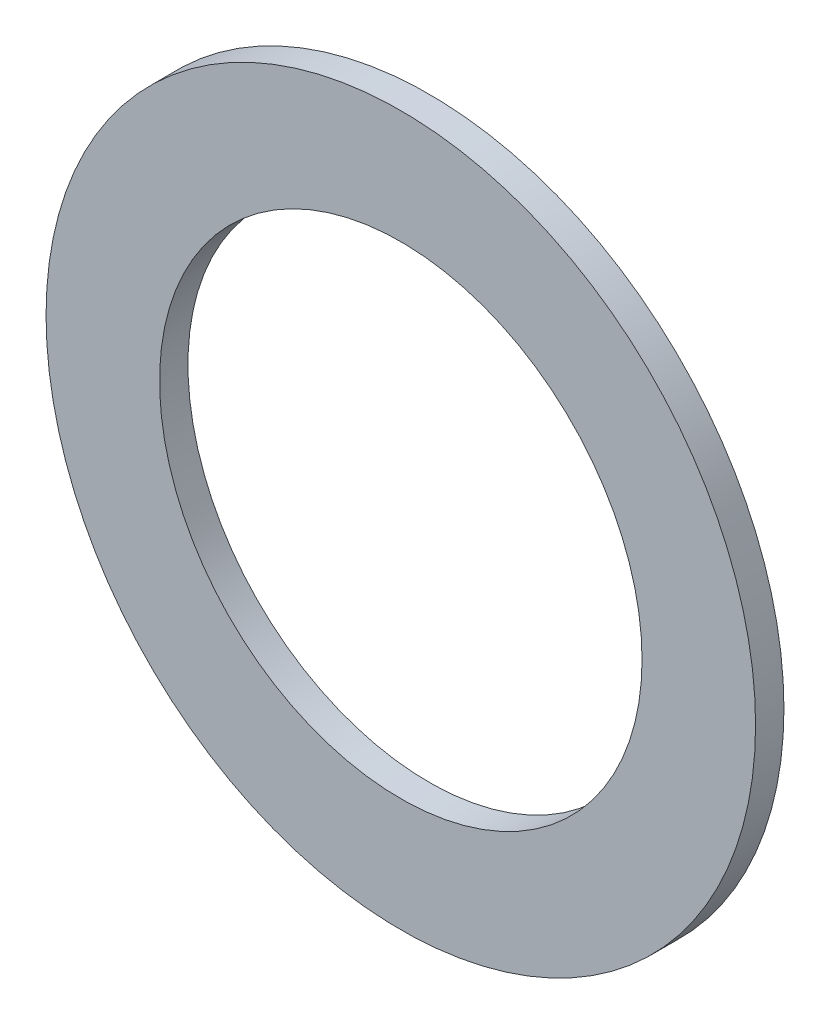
from build123d import *

# Parameters (mm, degrees)
ESQUISSE1_R          = 25
ESQUISSE1_R_2        = 17
BASE_EXTRUSION_DEPTH = 2


with BuildPart() as part:
    # Esquisse1 → Base-Extrusion (new body)
    with BuildSketch(Plane.XY):
        Circle(ESQUISSE1_R)
        Circle(ESQUISSE1_R_2, mode=Mode.SUBTRACT)
    extrude(amount=BASE_EXTRUSION_DEPTH)


solid = part.part
